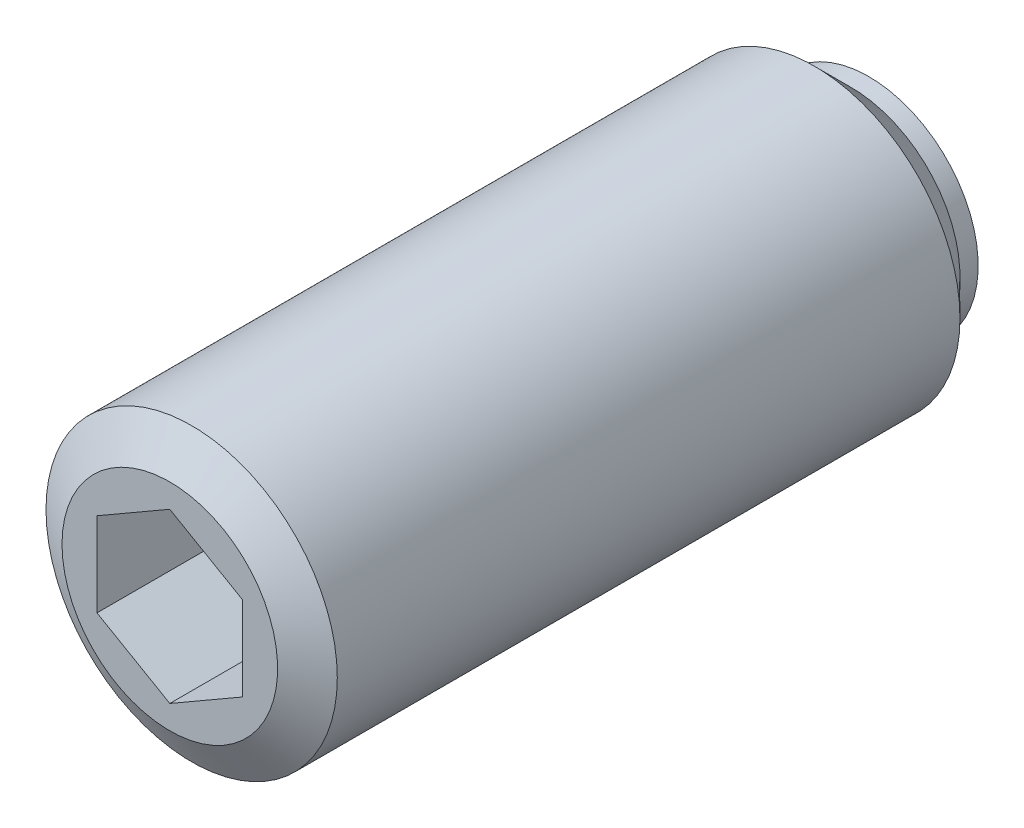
ISO-10303-21;
HEADER;
FILE_DESCRIPTION(('STEP AP214'),'2;1');
FILE_NAME('part.step','',(''),(''),'','','');
FILE_SCHEMA(('AUTOMOTIVE_DESIGN { 1 0 10303 214 1 1 1 1 }'));
ENDSEC;
DATA;
#1=APPLICATION_CONTEXT('core data for automotive mechanical design processes');
#2=APPLICATION_PROTOCOL_DEFINITION('international standard','automotive_design',2000,#1);
#3=PRODUCT_CONTEXT('',#1,'mechanical');
#4=PRODUCT('Part','Part','',(#3));
#5=PRODUCT_RELATED_PRODUCT_CATEGORY('part','',(#4));
#6=PRODUCT_DEFINITION_FORMATION('','',#4);
#7=PRODUCT_DEFINITION_CONTEXT('part definition',#1,'design');
#8=PRODUCT_DEFINITION('design','',#6,#7);
#9=PRODUCT_DEFINITION_SHAPE('','',#8);
#10=(LENGTH_UNIT() NAMED_UNIT(*) SI_UNIT(.MILLI.,.METRE.));
#11=(NAMED_UNIT(*) PLANE_ANGLE_UNIT() SI_UNIT($,.RADIAN.));
#12=(NAMED_UNIT(*) SI_UNIT($,.STERADIAN.) SOLID_ANGLE_UNIT());
#13=UNCERTAINTY_MEASURE_WITH_UNIT(LENGTH_MEASURE(1.E-05),#10,'distance_accuracy_value','');
#14=(GEOMETRIC_REPRESENTATION_CONTEXT(3) GLOBAL_UNCERTAINTY_ASSIGNED_CONTEXT((#13)) GLOBAL_UNIT_ASSIGNED_CONTEXT((#10,
#11,#12)) REPRESENTATION_CONTEXT('',''));
#15=CARTESIAN_POINT('',(0.,0.,0.));
#16=DIRECTION('',(0.,0.,1.));
#17=DIRECTION('',(1.,0.,0.));
#18=AXIS2_PLACEMENT_3D('',#15,#16,#17);
#19=CARTESIAN_POINT('',(0.,0.,1.25));
#20=DIRECTION('',(0.,0.,1.));
#21=DIRECTION('',(0.,-1.,0.));
#22=AXIS2_PLACEMENT_3D('',#19,#20,#21);
#23=SPHERICAL_SURFACE('',#22,1.25);
#24=CARTESIAN_POINT('',(0.,0.,0.4));
#25=DIRECTION('',(0.,0.,1.));
#26=DIRECTION('',(-1.,0.,0.));
#27=AXIS2_PLACEMENT_3D('',#24,#25,#26);
#28=CIRCLE('',#27,0.916515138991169);
#29=CARTESIAN_POINT('',(-0.916515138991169,0.,0.4));
#30=VERTEX_POINT('',#29);
#31=EDGE_CURVE('E9',#30,#30,#28,.T.);
#32=ORIENTED_EDGE('',*,*,#31,.F.);
#33=EDGE_LOOP('',(#32));
#34=FACE_BOUND('',#33,.T.);
#35=ADVANCED_FACE('F14',(#34),#23,.T.);
#36=CARTESIAN_POINT('',(0.,1.5,0.4));
#37=DIRECTION('',(0.,0.,1.));
#38=DIRECTION('',(-1.,0.,0.));
#39=AXIS2_PLACEMENT_3D('',#36,#37,#38);
#40=PLANE('',#39);
#41=CARTESIAN_POINT('',(0.,0.,0.4));
#42=DIRECTION('',(0.,0.,1.));
#43=DIRECTION('',(-1.,0.,0.));
#44=AXIS2_PLACEMENT_3D('',#41,#42,#43);
#45=CIRCLE('',#44,1.5);
#46=CARTESIAN_POINT('',(-1.5,0.,0.4));
#47=VERTEX_POINT('',#46);
#48=EDGE_CURVE('E21',#47,#47,#45,.T.);
#49=ORIENTED_EDGE('',*,*,#48,.F.);
#50=EDGE_LOOP('',(#49));
#51=FACE_BOUND('',#50,.T.);
#52=ORIENTED_EDGE('',*,*,#31,.T.);
#53=EDGE_LOOP('',(#52));
#54=FACE_BOUND('',#53,.T.);
#55=ADVANCED_FACE('F138',(#51,#54),#40,.F.);
#56=CARTESIAN_POINT('',(0.,0.,11.3950749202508));
#57=DIRECTION('',(0.,0.,1.));
#58=DIRECTION('',(-1.,0.,0.));
#59=AXIS2_PLACEMENT_3D('',#56,#57,#58);
#60=CYLINDRICAL_SURFACE('',#59,1.5);
#61=CARTESIAN_POINT('',(0.,0.,0.65));
#62=DIRECTION('',(0.,0.,1.));
#63=DIRECTION('',(-1.,0.,0.));
#64=AXIS2_PLACEMENT_3D('',#61,#62,#63);
#65=CIRCLE('',#64,1.5);
#66=CARTESIAN_POINT('',(-1.5,0.,0.65));
#67=VERTEX_POINT('',#66);
#68=EDGE_CURVE('E131',#67,#67,#65,.T.);
#69=ORIENTED_EDGE('',*,*,#68,.F.);
#70=EDGE_LOOP('',(#69));
#71=FACE_BOUND('',#70,.T.);
#72=ORIENTED_EDGE('',*,*,#48,.T.);
#73=EDGE_LOOP('',(#72));
#74=FACE_BOUND('',#73,.T.);
#75=ADVANCED_FACE('F136',(#71,#74),#60,.T.);
#76=CARTESIAN_POINT('',(0.,0.,0.65));
#77=DIRECTION('',(0.,0.,1.));
#78=DIRECTION('',(-1.,0.,0.));
#79=AXIS2_PLACEMENT_3D('',#76,#77,#78);
#80=CONICAL_SURFACE('',#79,1.5,0.78539816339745);
#81=CARTESIAN_POINT('',(0.,0.,1.15));
#82=DIRECTION('',(0.,0.,1.));
#83=DIRECTION('',(-1.,0.,0.));
#84=AXIS2_PLACEMENT_3D('',#81,#82,#83);
#85=CIRCLE('',#84,2.);
#86=CARTESIAN_POINT('',(-2.,0.,1.15));
#87=VERTEX_POINT('',#86);
#88=EDGE_CURVE('E128',#87,#87,#85,.T.);
#89=ORIENTED_EDGE('',*,*,#88,.F.);
#90=EDGE_LOOP('',(#89));
#91=FACE_BOUND('',#90,.T.);
#92=ORIENTED_EDGE('',*,*,#68,.T.);
#93=EDGE_LOOP('',(#92));
#94=FACE_BOUND('',#93,.T.);
#95=ADVANCED_FACE('F161',(#91,#94),#80,.T.);
#96=CARTESIAN_POINT('',(0.,0.,11.3950749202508));
#97=DIRECTION('',(0.,0.,1.));
#98=DIRECTION('',(-1.,0.,0.));
#99=AXIS2_PLACEMENT_3D('',#96,#97,#98);
#100=CYLINDRICAL_SURFACE('',#99,2.);
#101=CARTESIAN_POINT('',(0.,0.,9.7));
#102=DIRECTION('',(0.,0.,1.));
#103=DIRECTION('',(-1.,0.,0.));
#104=AXIS2_PLACEMENT_3D('',#101,#102,#103);
#105=CIRCLE('',#104,2.);
#106=CARTESIAN_POINT('',(-2.,0.,9.7));
#107=VERTEX_POINT('',#106);
#108=EDGE_CURVE('E125',#107,#107,#105,.T.);
#109=ORIENTED_EDGE('',*,*,#108,.F.);
#110=EDGE_LOOP('',(#109));
#111=FACE_BOUND('',#110,.T.);
#112=ORIENTED_EDGE('',*,*,#88,.T.);
#113=EDGE_LOOP('',(#112));
#114=FACE_BOUND('',#113,.T.);
#115=ADVANCED_FACE('F170',(#111,#114),#100,.T.);
#116=CARTESIAN_POINT('',(0.,0.,9.7));
#117=DIRECTION('',(0.,0.,-1.));
#118=DIRECTION('',(1.,0.,0.));
#119=AXIS2_PLACEMENT_3D('',#116,#117,#118);
#120=CONICAL_SURFACE('',#119,2.,1.04719755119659);
#121=CARTESIAN_POINT('',(0.,0.,10.));
#122=DIRECTION('',(0.,0.,1.));
#123=DIRECTION('',(-1.,0.,0.));
#124=AXIS2_PLACEMENT_3D('',#121,#122,#123);
#125=CIRCLE('',#124,1.48038475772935);
#126=CARTESIAN_POINT('',(-1.48038475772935,0.,10.));
#127=VERTEX_POINT('',#126);
#128=EDGE_CURVE('E116',#127,#127,#125,.T.);
#129=ORIENTED_EDGE('',*,*,#128,.F.);
#130=EDGE_LOOP('',(#129));
#131=FACE_BOUND('',#130,.T.);
#132=ORIENTED_EDGE('',*,*,#108,.T.);
#133=EDGE_LOOP('',(#132));
#134=FACE_BOUND('',#133,.T.);
#135=ADVANCED_FACE('F179',(#131,#134),#120,.T.);
#136=CARTESIAN_POINT('',(0.,0.,10.));
#137=DIRECTION('',(0.,0.,-1.));
#138=DIRECTION('',(1.,0.,0.));
#139=AXIS2_PLACEMENT_3D('',#136,#137,#138);
#140=PLANE('',#139);
#141=DIRECTION('',(-0.866025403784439,-0.5,0.));
#142=VECTOR('',#141,1.);
#143=CARTESIAN_POINT('',(0.,1.15470053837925,10.));
#144=LINE('',#143,#142);
#145=CARTESIAN_POINT('',(0.,1.15470053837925,10.));
#146=VERTEX_POINT('',#145);
#147=CARTESIAN_POINT('',(-1.,0.577350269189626,10.));
#148=VERTEX_POINT('',#147);
#149=EDGE_CURVE('E82',#146,#148,#144,.T.);
#150=ORIENTED_EDGE('',*,*,#149,.F.);
#151=DIRECTION('',(-0.866025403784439,0.5,0.));
#152=VECTOR('',#151,1.);
#153=CARTESIAN_POINT('',(1.,0.577350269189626,10.));
#154=LINE('',#153,#152);
#155=CARTESIAN_POINT('',(1.,0.577350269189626,10.));
#156=VERTEX_POINT('',#155);
#157=EDGE_CURVE('E28',#156,#146,#154,.T.);
#158=ORIENTED_EDGE('',*,*,#157,.F.);
#159=DIRECTION('',(0.,1.,0.));
#160=VECTOR('',#159,1.);
#161=CARTESIAN_POINT('',(1.,-0.577350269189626,10.));
#162=LINE('',#161,#160);
#163=CARTESIAN_POINT('',(1.,-0.577350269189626,10.));
#164=VERTEX_POINT('',#163);
#165=EDGE_CURVE('E98',#164,#156,#162,.T.);
#166=ORIENTED_EDGE('',*,*,#165,.F.);
#167=DIRECTION('',(0.866025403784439,0.5,0.));
#168=VECTOR('',#167,1.);
#169=CARTESIAN_POINT('',(0.,-1.15470053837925,10.));
#170=LINE('',#169,#168);
#171=CARTESIAN_POINT('',(0.,-1.15470053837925,10.));
#172=VERTEX_POINT('',#171);
#173=EDGE_CURVE('E92',#172,#164,#170,.T.);
#174=ORIENTED_EDGE('',*,*,#173,.F.);
#175=DIRECTION('',(0.866025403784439,-0.5,0.));
#176=VECTOR('',#175,1.);
#177=CARTESIAN_POINT('',(-1.,-0.577350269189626,10.));
#178=LINE('',#177,#176);
#179=CARTESIAN_POINT('',(-1.,-0.577350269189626,10.));
#180=VERTEX_POINT('',#179);
#181=EDGE_CURVE('E90',#180,#172,#178,.T.);
#182=ORIENTED_EDGE('',*,*,#181,.F.);
#183=DIRECTION('',(0.,-1.,0.));
#184=VECTOR('',#183,1.);
#185=CARTESIAN_POINT('',(-1.,0.577350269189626,10.));
#186=LINE('',#185,#184);
#187=EDGE_CURVE('E71',#148,#180,#186,.T.);
#188=ORIENTED_EDGE('',*,*,#187,.F.);
#189=EDGE_LOOP('',(#150,#158,#166,#174,#182,#188));
#190=FACE_BOUND('',#189,.T.);
#191=ORIENTED_EDGE('',*,*,#128,.T.);
#192=EDGE_LOOP('',(#191));
#193=FACE_BOUND('',#192,.T.);
#194=ADVANCED_FACE('F86',(#190,#193),#140,.F.);
#195=CARTESIAN_POINT('',(1.,0.577350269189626,8.));
#196=DIRECTION('',(0.5,0.866025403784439,0.));
#197=DIRECTION('',(0.866025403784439,-0.5,0.));
#198=AXIS2_PLACEMENT_3D('',#195,#196,#197);
#199=PLANE('',#198);
#200=ORIENTED_EDGE('',*,*,#157,.T.);
#201=DIRECTION('',(0.,0.,1.));
#202=VECTOR('',#201,1.);
#203=CARTESIAN_POINT('',(0.,1.15470053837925,8.));
#204=LINE('',#203,#202);
#205=CARTESIAN_POINT('',(0.,1.15470053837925,8.));
#206=VERTEX_POINT('',#205);
#207=EDGE_CURVE('E79',#206,#146,#204,.T.);
#208=ORIENTED_EDGE('',*,*,#207,.F.);
#209=DIRECTION('',(-0.866025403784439,0.5,0.));
#210=VECTOR('',#209,1.);
#211=CARTESIAN_POINT('',(1.,0.577350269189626,8.));
#212=LINE('',#211,#210);
#213=CARTESIAN_POINT('',(1.,0.577350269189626,8.));
#214=VERTEX_POINT('',#213);
#215=EDGE_CURVE('E100',#214,#206,#212,.T.);
#216=ORIENTED_EDGE('',*,*,#215,.F.);
#217=DIRECTION('',(0.,0.,1.));
#218=VECTOR('',#217,1.);
#219=CARTESIAN_POINT('',(1.,0.577350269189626,8.));
#220=LINE('',#219,#218);
#221=EDGE_CURVE('E35',#214,#156,#220,.T.);
#222=ORIENTED_EDGE('',*,*,#221,.T.);
#223=EDGE_LOOP('',(#200,#208,#216,#222));
#224=FACE_BOUND('',#223,.T.);
#225=ADVANCED_FACE('F196',(#224),#199,.F.);
#226=CARTESIAN_POINT('',(1.,-0.577350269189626,8.));
#227=DIRECTION('',(1.,0.,0.));
#228=DIRECTION('',(0.,-1.,0.));
#229=AXIS2_PLACEMENT_3D('',#226,#227,#228);
#230=PLANE('',#229);
#231=ORIENTED_EDGE('',*,*,#165,.T.);
#232=ORIENTED_EDGE('',*,*,#221,.F.);
#233=DIRECTION('',(0.,1.,0.));
#234=VECTOR('',#233,1.);
#235=CARTESIAN_POINT('',(1.,-0.577350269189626,8.));
#236=LINE('',#235,#234);
#237=CARTESIAN_POINT('',(1.,-0.577350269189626,8.));
#238=VERTEX_POINT('',#237);
#239=EDGE_CURVE('E112',#238,#214,#236,.T.);
#240=ORIENTED_EDGE('',*,*,#239,.F.);
#241=DIRECTION('',(0.,0.,1.));
#242=VECTOR('',#241,1.);
#243=CARTESIAN_POINT('',(1.,-0.577350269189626,8.));
#244=LINE('',#243,#242);
#245=EDGE_CURVE('E117',#238,#164,#244,.T.);
#246=ORIENTED_EDGE('',*,*,#245,.T.);
#247=EDGE_LOOP('',(#231,#232,#240,#246));
#248=FACE_BOUND('',#247,.T.);
#249=ADVANCED_FACE('F204',(#248),#230,.F.);
#250=CARTESIAN_POINT('',(0.,-1.15470053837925,8.));
#251=DIRECTION('',(0.5,-0.866025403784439,0.));
#252=DIRECTION('',(-0.866025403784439,-0.5,0.));
#253=AXIS2_PLACEMENT_3D('',#250,#251,#252);
#254=PLANE('',#253);
#255=ORIENTED_EDGE('',*,*,#173,.T.);
#256=ORIENTED_EDGE('',*,*,#245,.F.);
#257=DIRECTION('',(0.866025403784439,0.5,0.));
#258=VECTOR('',#257,1.);
#259=CARTESIAN_POINT('',(0.,-1.15470053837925,8.));
#260=LINE('',#259,#258);
#261=CARTESIAN_POINT('',(0.,-1.15470053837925,8.));
#262=VERTEX_POINT('',#261);
#263=EDGE_CURVE('E109',#262,#238,#260,.T.);
#264=ORIENTED_EDGE('',*,*,#263,.F.);
#265=DIRECTION('',(0.,0.,1.));
#266=VECTOR('',#265,1.);
#267=CARTESIAN_POINT('',(0.,-1.15470053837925,8.));
#268=LINE('',#267,#266);
#269=EDGE_CURVE('E119',#262,#172,#268,.T.);
#270=ORIENTED_EDGE('',*,*,#269,.T.);
#271=EDGE_LOOP('',(#255,#256,#264,#270));
#272=FACE_BOUND('',#271,.T.);
#273=ADVANCED_FACE('F212',(#272),#254,.F.);
#274=CARTESIAN_POINT('',(-1.,-0.577350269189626,8.));
#275=DIRECTION('',(-0.5,-0.866025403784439,0.));
#276=DIRECTION('',(-0.866025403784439,0.5,0.));
#277=AXIS2_PLACEMENT_3D('',#274,#275,#276);
#278=PLANE('',#277);
#279=ORIENTED_EDGE('',*,*,#181,.T.);
#280=ORIENTED_EDGE('',*,*,#269,.F.);
#281=DIRECTION('',(0.866025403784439,-0.5,0.));
#282=VECTOR('',#281,1.);
#283=CARTESIAN_POINT('',(-1.,-0.577350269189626,8.));
#284=LINE('',#283,#282);
#285=CARTESIAN_POINT('',(-1.,-0.577350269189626,8.));
#286=VERTEX_POINT('',#285);
#287=EDGE_CURVE('E106',#286,#262,#284,.T.);
#288=ORIENTED_EDGE('',*,*,#287,.F.);
#289=DIRECTION('',(0.,0.,1.));
#290=VECTOR('',#289,1.);
#291=CARTESIAN_POINT('',(-1.,-0.577350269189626,8.));
#292=LINE('',#291,#290);
#293=EDGE_CURVE('E78',#286,#180,#292,.T.);
#294=ORIENTED_EDGE('',*,*,#293,.T.);
#295=EDGE_LOOP('',(#279,#280,#288,#294));
#296=FACE_BOUND('',#295,.T.);
#297=ADVANCED_FACE('F220',(#296),#278,.F.);
#298=CARTESIAN_POINT('',(-1.,0.577350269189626,8.));
#299=DIRECTION('',(-1.,0.,0.));
#300=DIRECTION('',(0.,1.,0.));
#301=AXIS2_PLACEMENT_3D('',#298,#299,#300);
#302=PLANE('',#301);
#303=ORIENTED_EDGE('',*,*,#187,.T.);
#304=ORIENTED_EDGE('',*,*,#293,.F.);
#305=DIRECTION('',(0.,-1.,0.));
#306=VECTOR('',#305,1.);
#307=CARTESIAN_POINT('',(-1.,0.577350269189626,8.));
#308=LINE('',#307,#306);
#309=CARTESIAN_POINT('',(-1.,0.577350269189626,8.));
#310=VERTEX_POINT('',#309);
#311=EDGE_CURVE('E74',#310,#286,#308,.T.);
#312=ORIENTED_EDGE('',*,*,#311,.F.);
#313=DIRECTION('',(0.,0.,1.));
#314=VECTOR('',#313,1.);
#315=CARTESIAN_POINT('',(-1.,0.577350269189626,8.));
#316=LINE('',#315,#314);
#317=EDGE_CURVE('E67',#310,#148,#316,.T.);
#318=ORIENTED_EDGE('',*,*,#317,.T.);
#319=EDGE_LOOP('',(#303,#304,#312,#318));
#320=FACE_BOUND('',#319,.T.);
#321=ADVANCED_FACE('F69',(#320),#302,.F.);
#322=CARTESIAN_POINT('',(0.,1.15470053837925,8.));
#323=DIRECTION('',(-0.5,0.866025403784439,0.));
#324=DIRECTION('',(0.866025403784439,0.5,0.));
#325=AXIS2_PLACEMENT_3D('',#322,#323,#324);
#326=PLANE('',#325);
#327=ORIENTED_EDGE('',*,*,#149,.T.);
#328=ORIENTED_EDGE('',*,*,#317,.F.);
#329=DIRECTION('',(-0.866025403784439,-0.5,0.));
#330=VECTOR('',#329,1.);
#331=CARTESIAN_POINT('',(0.,1.15470053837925,8.));
#332=LINE('',#331,#330);
#333=EDGE_CURVE('E103',#206,#310,#332,.T.);
#334=ORIENTED_EDGE('',*,*,#333,.F.);
#335=ORIENTED_EDGE('',*,*,#207,.T.);
#336=EDGE_LOOP('',(#327,#328,#334,#335));
#337=FACE_BOUND('',#336,.T.);
#338=ADVANCED_FACE('F83',(#337),#326,.F.);
#339=CARTESIAN_POINT('',(0.,1.15470053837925,8.));
#340=DIRECTION('',(0.,0.,1.));
#341=DIRECTION('',(-1.,0.,0.));
#342=AXIS2_PLACEMENT_3D('',#339,#340,#341);
#343=PLANE('',#342);
#344=ORIENTED_EDGE('',*,*,#215,.T.);
#345=ORIENTED_EDGE('',*,*,#333,.T.);
#346=ORIENTED_EDGE('',*,*,#311,.T.);
#347=ORIENTED_EDGE('',*,*,#287,.T.);
#348=ORIENTED_EDGE('',*,*,#263,.T.);
#349=ORIENTED_EDGE('',*,*,#239,.T.);
#350=EDGE_LOOP('',(#344,#345,#346,#347,#348,#349));
#351=FACE_BOUND('',#350,.T.);
#352=ADVANCED_FACE('F244',(#351),#343,.T.);
#353=CLOSED_SHELL('',(#35,#55,#75,#95,#115,#135,#194,#225,#249,#273,#297,#321,#338,#352));
#354=MANIFOLD_SOLID_BREP('B1',#353);
#355=ADVANCED_BREP_SHAPE_REPRESENTATION('',(#18,#354),#14);
#356=SHAPE_DEFINITION_REPRESENTATION(#9,#355);
ENDSEC;
END-ISO-10303-21;
